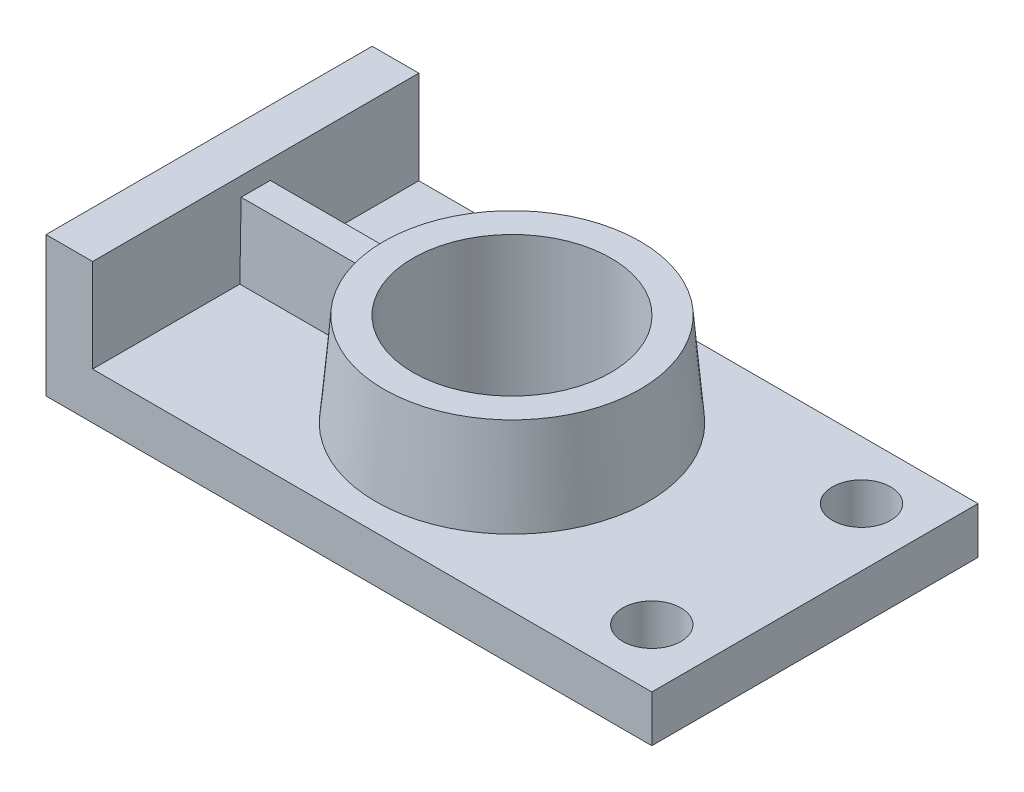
ISO-10303-21;
HEADER;
FILE_DESCRIPTION(('STEP AP214'),'2;1');
FILE_NAME('part.step','',(''),(''),'','','');
FILE_SCHEMA(('AUTOMOTIVE_DESIGN { 1 0 10303 214 1 1 1 1 }'));
ENDSEC;
DATA;
#1=APPLICATION_CONTEXT('core data for automotive mechanical design processes');
#2=APPLICATION_PROTOCOL_DEFINITION('international standard','automotive_design',2000,#1);
#3=PRODUCT_CONTEXT('',#1,'mechanical');
#4=PRODUCT('Part','Part','',(#3));
#5=PRODUCT_RELATED_PRODUCT_CATEGORY('part','',(#4));
#6=PRODUCT_DEFINITION_FORMATION('','',#4);
#7=PRODUCT_DEFINITION_CONTEXT('part definition',#1,'design');
#8=PRODUCT_DEFINITION('design','',#6,#7);
#9=PRODUCT_DEFINITION_SHAPE('','',#8);
#10=(LENGTH_UNIT() NAMED_UNIT(*) SI_UNIT(.MILLI.,.METRE.));
#11=(NAMED_UNIT(*) PLANE_ANGLE_UNIT() SI_UNIT($,.RADIAN.));
#12=(NAMED_UNIT(*) SI_UNIT($,.STERADIAN.) SOLID_ANGLE_UNIT());
#13=UNCERTAINTY_MEASURE_WITH_UNIT(LENGTH_MEASURE(1.E-05),#10,'distance_accuracy_value','');
#14=(GEOMETRIC_REPRESENTATION_CONTEXT(3) GLOBAL_UNCERTAINTY_ASSIGNED_CONTEXT((#13)) GLOBAL_UNIT_ASSIGNED_CONTEXT((#10,
#11,#12)) REPRESENTATION_CONTEXT('',''));
#15=CARTESIAN_POINT('',(0.,0.,0.));
#16=DIRECTION('',(0.,0.,1.));
#17=DIRECTION('',(1.,0.,0.));
#18=AXIS2_PLACEMENT_3D('',#15,#16,#17);
#19=CARTESIAN_POINT('',(0.,0.,-88.9));
#20=DIRECTION('',(0.,-1.,0.));
#21=DIRECTION('',(0.,0.,-1.));
#22=AXIS2_PLACEMENT_3D('',#19,#20,#21);
#23=PLANE('',#22);
#24=CARTESIAN_POINT('',(82.55,0.,-44.4500000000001));
#25=DIRECTION('',(0.,1.,0.));
#26=DIRECTION('',(0.,0.,1.));
#27=AXIS2_PLACEMENT_3D('',#24,#25,#26);
#28=CIRCLE('',#27,26.9875);
#29=CARTESIAN_POINT('',(82.55,0.,-17.4625000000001));
#30=VERTEX_POINT('',#29);
#31=EDGE_CURVE('E130',#30,#30,#28,.T.);
#32=ORIENTED_EDGE('',*,*,#31,.T.);
#33=EDGE_LOOP('',(#32));
#34=FACE_BOUND('',#33,.T.);
#35=DIRECTION('',(0.,0.,1.));
#36=VECTOR('',#35,1.);
#37=CARTESIAN_POINT('',(165.1,0.,-88.9));
#38=LINE('',#37,#36);
#39=CARTESIAN_POINT('',(165.1,0.,-88.9));
#40=VERTEX_POINT('',#39);
#41=CARTESIAN_POINT('',(165.1,0.,0.));
#42=VERTEX_POINT('',#41);
#43=EDGE_CURVE('E200',#40,#42,#38,.T.);
#44=ORIENTED_EDGE('',*,*,#43,.T.);
#45=DIRECTION('',(1.,0.,0.));
#46=VECTOR('',#45,1.);
#47=CARTESIAN_POINT('',(0.,0.,0.));
#48=LINE('',#47,#46);
#49=CARTESIAN_POINT('',(0.,0.,0.));
#50=VERTEX_POINT('',#49);
#51=EDGE_CURVE('E183',#50,#42,#48,.T.);
#52=ORIENTED_EDGE('',*,*,#51,.F.);
#53=DIRECTION('',(0.,0.,1.));
#54=VECTOR('',#53,1.);
#55=CARTESIAN_POINT('',(0.,0.,-88.9));
#56=LINE('',#55,#54);
#57=CARTESIAN_POINT('',(0.,0.,-88.9));
#58=VERTEX_POINT('',#57);
#59=EDGE_CURVE('E120',#58,#50,#56,.T.);
#60=ORIENTED_EDGE('',*,*,#59,.F.);
#61=DIRECTION('',(1.,0.,0.));
#62=VECTOR('',#61,1.);
#63=CARTESIAN_POINT('',(0.,0.,-88.9));
#64=LINE('',#63,#62);
#65=EDGE_CURVE('E185',#58,#40,#64,.T.);
#66=ORIENTED_EDGE('',*,*,#65,.T.);
#67=EDGE_LOOP('',(#44,#52,#60,#66));
#68=FACE_BOUND('',#67,.T.);
#69=CARTESIAN_POINT('',(149.225,0.,-73.025));
#70=DIRECTION('',(0.,1.,0.));
#71=DIRECTION('',(0.,0.,1.));
#72=AXIS2_PLACEMENT_3D('',#69,#70,#71);
#73=CIRCLE('',#72,7.93749999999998);
#74=CARTESIAN_POINT('',(149.225,0.,-65.0875));
#75=VERTEX_POINT('',#74);
#76=EDGE_CURVE('E144',#75,#75,#73,.T.);
#77=ORIENTED_EDGE('',*,*,#76,.T.);
#78=EDGE_LOOP('',(#77));
#79=FACE_BOUND('',#78,.T.);
#80=CARTESIAN_POINT('',(149.225,0.,-15.875));
#81=DIRECTION('',(0.,1.,0.));
#82=DIRECTION('',(0.,0.,1.));
#83=AXIS2_PLACEMENT_3D('',#80,#81,#82);
#84=CIRCLE('',#83,7.93749999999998);
#85=CARTESIAN_POINT('',(149.225,0.,-7.93750000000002));
#86=VERTEX_POINT('',#85);
#87=EDGE_CURVE('E172',#86,#86,#84,.T.);
#88=ORIENTED_EDGE('',*,*,#87,.T.);
#89=EDGE_LOOP('',(#88));
#90=FACE_BOUND('',#89,.T.);
#91=ADVANCED_FACE('F32',(#34,#68,#79,#90),#23,.T.);
#92=CARTESIAN_POINT('',(0.,38.1,-88.9));
#93=DIRECTION('',(-1.,0.,0.));
#94=DIRECTION('',(0.,-1.,0.));
#95=AXIS2_PLACEMENT_3D('',#92,#93,#94);
#96=PLANE('',#95);
#97=ORIENTED_EDGE('',*,*,#59,.T.);
#98=DIRECTION('',(0.,-1.,0.));
#99=VECTOR('',#98,1.);
#100=CARTESIAN_POINT('',(0.,38.1,0.));
#101=LINE('',#100,#99);
#102=CARTESIAN_POINT('',(0.,38.1,0.));
#103=VERTEX_POINT('',#102);
#104=EDGE_CURVE('E189',#103,#50,#101,.T.);
#105=ORIENTED_EDGE('',*,*,#104,.F.);
#106=DIRECTION('',(0.,0.,1.));
#107=VECTOR('',#106,1.);
#108=CARTESIAN_POINT('',(0.,38.1,-88.9));
#109=LINE('',#108,#107);
#110=CARTESIAN_POINT('',(0.,38.1,-88.9));
#111=VERTEX_POINT('',#110);
#112=EDGE_CURVE('E217',#111,#103,#109,.T.);
#113=ORIENTED_EDGE('',*,*,#112,.F.);
#114=DIRECTION('',(0.,-1.,0.));
#115=VECTOR('',#114,1.);
#116=CARTESIAN_POINT('',(0.,38.1,-88.9));
#117=LINE('',#116,#115);
#118=EDGE_CURVE('E197',#111,#58,#117,.T.);
#119=ORIENTED_EDGE('',*,*,#118,.T.);
#120=EDGE_LOOP('',(#97,#105,#113,#119));
#121=FACE_BOUND('',#120,.T.);
#122=ADVANCED_FACE('F243',(#121),#96,.T.);
#123=CARTESIAN_POINT('',(0.,38.1,-88.9));
#124=DIRECTION('',(0.,-1.,0.));
#125=DIRECTION('',(0.,0.,-1.));
#126=AXIS2_PLACEMENT_3D('',#123,#124,#125);
#127=PLANE('',#126);
#128=DIRECTION('',(1.,0.,0.));
#129=VECTOR('',#128,1.);
#130=CARTESIAN_POINT('',(0.,38.1,0.));
#131=LINE('',#130,#129);
#132=CARTESIAN_POINT('',(12.7,38.1,0.));
#133=VERTEX_POINT('',#132);
#134=EDGE_CURVE('E212',#103,#133,#131,.T.);
#135=ORIENTED_EDGE('',*,*,#134,.T.);
#136=DIRECTION('',(0.,0.,1.));
#137=VECTOR('',#136,1.);
#138=CARTESIAN_POINT('',(12.7,38.1,-88.9));
#139=LINE('',#138,#137);
#140=CARTESIAN_POINT('',(12.7,38.1,-88.9));
#141=VERTEX_POINT('',#140);
#142=EDGE_CURVE('E219',#141,#133,#139,.T.);
#143=ORIENTED_EDGE('',*,*,#142,.F.);
#144=DIRECTION('',(1.,0.,0.));
#145=VECTOR('',#144,1.);
#146=CARTESIAN_POINT('',(0.,38.1,-88.9));
#147=LINE('',#146,#145);
#148=EDGE_CURVE('E195',#111,#141,#147,.T.);
#149=ORIENTED_EDGE('',*,*,#148,.F.);
#150=ORIENTED_EDGE('',*,*,#112,.T.);
#151=EDGE_LOOP('',(#135,#143,#149,#150));
#152=FACE_BOUND('',#151,.T.);
#153=ADVANCED_FACE('F252',(#152),#127,.F.);
#154=CARTESIAN_POINT('',(12.7,38.1,-88.9));
#155=DIRECTION('',(-1.,0.,0.));
#156=DIRECTION('',(0.,-1.,0.));
#157=AXIS2_PLACEMENT_3D('',#154,#155,#156);
#158=PLANE('',#157);
#159=DIRECTION('',(0.,0.,1.));
#160=VECTOR('',#159,1.);
#161=CARTESIAN_POINT('',(12.7,12.7,-88.9));
#162=LINE('',#161,#160);
#163=CARTESIAN_POINT('',(12.7,12.7,-40.1265630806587));
#164=VERTEX_POINT('',#163);
#165=CARTESIAN_POINT('',(12.7,12.7,0.));
#166=VERTEX_POINT('',#165);
#167=EDGE_CURVE('E223',#164,#166,#162,.T.);
#168=ORIENTED_EDGE('',*,*,#167,.F.);
#169=DIRECTION('',(0.,-0.999847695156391,0.0174524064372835));
#170=VECTOR('',#169,1.);
#171=CARTESIAN_POINT('',(12.7,38.9433477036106,-40.584642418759));
#172=LINE('',#171,#170);
#173=CARTESIAN_POINT('',(12.7,33.02,-40.4812500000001));
#174=VERTEX_POINT('',#173);
#175=EDGE_CURVE('E159',#164,#174,#172,.F.);
#176=ORIENTED_EDGE('',*,*,#175,.T.);
#177=DIRECTION('',(0.,0.,-1.));
#178=VECTOR('',#177,1.);
#179=CARTESIAN_POINT('',(12.7,33.02,-88.9));
#180=LINE('',#179,#178);
#181=CARTESIAN_POINT('',(12.7,33.02,-48.4187500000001));
#182=VERTEX_POINT('',#181);
#183=EDGE_CURVE('E160',#174,#182,#180,.T.);
#184=ORIENTED_EDGE('',*,*,#183,.T.);
#185=DIRECTION('',(0.,0.999847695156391,0.0174524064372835));
#186=VECTOR('',#185,1.);
#187=CARTESIAN_POINT('',(12.7,37.3920650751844,-48.3424353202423));
#188=LINE('',#187,#186);
#189=CARTESIAN_POINT('',(12.7,12.7,-48.7734369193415));
#190=VERTEX_POINT('',#189);
#191=EDGE_CURVE('E157',#190,#182,#188,.T.);
#192=ORIENTED_EDGE('',*,*,#191,.F.);
#193=CARTESIAN_POINT('',(12.7,12.7,-88.9));
#194=VERTEX_POINT('',#193);
#195=EDGE_CURVE('E116',#194,#190,#162,.T.);
#196=ORIENTED_EDGE('',*,*,#195,.F.);
#197=DIRECTION('',(0.,-1.,0.));
#198=VECTOR('',#197,1.);
#199=CARTESIAN_POINT('',(12.7,38.1,-88.9));
#200=LINE('',#199,#198);
#201=EDGE_CURVE('E193',#141,#194,#200,.T.);
#202=ORIENTED_EDGE('',*,*,#201,.F.);
#203=ORIENTED_EDGE('',*,*,#142,.T.);
#204=DIRECTION('',(0.,-1.,0.));
#205=VECTOR('',#204,1.);
#206=CARTESIAN_POINT('',(12.7,38.1,0.));
#207=LINE('',#206,#205);
#208=EDGE_CURVE('E209',#133,#166,#207,.T.);
#209=ORIENTED_EDGE('',*,*,#208,.T.);
#210=EDGE_LOOP('',(#168,#176,#184,#192,#196,#202,#203,#209));
#211=FACE_BOUND('',#210,.T.);
#212=ADVANCED_FACE('F249',(#211),#158,.F.);
#213=CARTESIAN_POINT('',(0.,12.7,-88.9));
#214=DIRECTION('',(0.,-1.,0.));
#215=DIRECTION('',(0.,0.,-1.));
#216=AXIS2_PLACEMENT_3D('',#213,#214,#215);
#217=PLANE('',#216);
#218=DIRECTION('',(-1.,0.,0.));
#219=VECTOR('',#218,1.);
#220=CARTESIAN_POINT('',(0.,12.7,-48.7734369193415));
#221=LINE('',#220,#219);
#222=CARTESIAN_POINT('',(45.655240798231,12.7,-48.7734369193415));
#223=VERTEX_POINT('',#222);
#224=EDGE_CURVE('E39',#223,#190,#221,.T.);
#225=ORIENTED_EDGE('',*,*,#224,.F.);
#226=CARTESIAN_POINT('',(82.55,12.7,-44.4500000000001));
#227=DIRECTION('',(0.,-1.,0.));
#228=DIRECTION('',(0.,0.,-1.));
#229=AXIS2_PLACEMENT_3D('',#226,#227,#228);
#230=CIRCLE('',#229,37.1472120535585);
#231=CARTESIAN_POINT('',(45.655240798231,12.7,-40.1265630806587));
#232=VERTEX_POINT('',#231);
#233=EDGE_CURVE('E113',#232,#223,#230,.F.);
#234=ORIENTED_EDGE('',*,*,#233,.F.);
#235=DIRECTION('',(1.,0.,0.));
#236=VECTOR('',#235,1.);
#237=CARTESIAN_POINT('',(0.,12.7,-40.1265630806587));
#238=LINE('',#237,#236);
#239=EDGE_CURVE('E11',#232,#164,#238,.F.);
#240=ORIENTED_EDGE('',*,*,#239,.T.);
#241=ORIENTED_EDGE('',*,*,#167,.T.);
#242=DIRECTION('',(1.,0.,0.));
#243=VECTOR('',#242,1.);
#244=CARTESIAN_POINT('',(0.,12.7,0.));
#245=LINE('',#244,#243);
#246=CARTESIAN_POINT('',(165.1,12.7,0.));
#247=VERTEX_POINT('',#246);
#248=EDGE_CURVE('E206',#166,#247,#245,.T.);
#249=ORIENTED_EDGE('',*,*,#248,.T.);
#250=DIRECTION('',(0.,0.,1.));
#251=VECTOR('',#250,1.);
#252=CARTESIAN_POINT('',(165.1,12.7,-88.9));
#253=LINE('',#252,#251);
#254=CARTESIAN_POINT('',(165.1,12.7,-88.9));
#255=VERTEX_POINT('',#254);
#256=EDGE_CURVE('E224',#255,#247,#253,.T.);
#257=ORIENTED_EDGE('',*,*,#256,.F.);
#258=DIRECTION('',(1.,0.,0.));
#259=VECTOR('',#258,1.);
#260=CARTESIAN_POINT('',(0.,12.7,-88.9));
#261=LINE('',#260,#259);
#262=EDGE_CURVE('E191',#194,#255,#261,.T.);
#263=ORIENTED_EDGE('',*,*,#262,.F.);
#264=ORIENTED_EDGE('',*,*,#195,.T.);
#265=EDGE_LOOP('',(#225,#234,#240,#241,#249,#257,#263,#264));
#266=FACE_BOUND('',#265,.T.);
#267=CARTESIAN_POINT('',(149.225,12.7,-73.025));
#268=DIRECTION('',(0.,1.,0.));
#269=DIRECTION('',(0.,0.,1.));
#270=AXIS2_PLACEMENT_3D('',#267,#268,#269);
#271=CIRCLE('',#270,7.93749999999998);
#272=CARTESIAN_POINT('',(149.225,12.7,-65.0875));
#273=VERTEX_POINT('',#272);
#274=EDGE_CURVE('E163',#273,#273,#271,.T.);
#275=ORIENTED_EDGE('',*,*,#274,.F.);
#276=EDGE_LOOP('',(#275));
#277=FACE_BOUND('',#276,.T.);
#278=CARTESIAN_POINT('',(149.225,12.7,-15.875));
#279=DIRECTION('',(0.,1.,0.));
#280=DIRECTION('',(0.,0.,1.));
#281=AXIS2_PLACEMENT_3D('',#278,#279,#280);
#282=CIRCLE('',#281,7.93749999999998);
#283=CARTESIAN_POINT('',(149.225,12.7,-7.93750000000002));
#284=VERTEX_POINT('',#283);
#285=EDGE_CURVE('E170',#284,#284,#282,.T.);
#286=ORIENTED_EDGE('',*,*,#285,.F.);
#287=EDGE_LOOP('',(#286));
#288=FACE_BOUND('',#287,.T.);
#289=ADVANCED_FACE('F111',(#266,#277,#288),#217,.F.);
#290=CARTESIAN_POINT('',(165.1,12.7,-88.9));
#291=DIRECTION('',(-1.,0.,0.));
#292=DIRECTION('',(0.,0.,1.));
#293=AXIS2_PLACEMENT_3D('',#290,#291,#292);
#294=PLANE('',#293);
#295=ORIENTED_EDGE('',*,*,#256,.T.);
#296=DIRECTION('',(0.,-1.,0.));
#297=VECTOR('',#296,1.);
#298=CARTESIAN_POINT('',(165.1,12.7,0.));
#299=LINE('',#298,#297);
#300=EDGE_CURVE('E203',#247,#42,#299,.T.);
#301=ORIENTED_EDGE('',*,*,#300,.T.);
#302=ORIENTED_EDGE('',*,*,#43,.F.);
#303=DIRECTION('',(0.,-1.,0.));
#304=VECTOR('',#303,1.);
#305=CARTESIAN_POINT('',(165.1,12.7,-88.9));
#306=LINE('',#305,#304);
#307=EDGE_CURVE('E188',#255,#40,#306,.T.);
#308=ORIENTED_EDGE('',*,*,#307,.F.);
#309=EDGE_LOOP('',(#295,#301,#302,#308));
#310=FACE_BOUND('',#309,.T.);
#311=ADVANCED_FACE('F234',(#310),#294,.F.);
#312=CARTESIAN_POINT('',(165.1,0.,-88.9));
#313=DIRECTION('',(0.,0.,-1.));
#314=DIRECTION('',(-1.,0.,0.));
#315=AXIS2_PLACEMENT_3D('',#312,#313,#314);
#316=PLANE('',#315);
#317=ORIENTED_EDGE('',*,*,#65,.F.);
#318=ORIENTED_EDGE('',*,*,#118,.F.);
#319=ORIENTED_EDGE('',*,*,#148,.T.);
#320=ORIENTED_EDGE('',*,*,#201,.T.);
#321=ORIENTED_EDGE('',*,*,#262,.T.);
#322=ORIENTED_EDGE('',*,*,#307,.T.);
#323=EDGE_LOOP('',(#317,#318,#319,#320,#321,#322));
#324=FACE_BOUND('',#323,.T.);
#325=ADVANCED_FACE('F247',(#324),#316,.T.);
#326=CARTESIAN_POINT('',(165.1,0.,0.));
#327=DIRECTION('',(0.,0.,-1.));
#328=DIRECTION('',(-1.,0.,0.));
#329=AXIS2_PLACEMENT_3D('',#326,#327,#328);
#330=PLANE('',#329);
#331=ORIENTED_EDGE('',*,*,#51,.T.);
#332=ORIENTED_EDGE('',*,*,#300,.F.);
#333=ORIENTED_EDGE('',*,*,#248,.F.);
#334=ORIENTED_EDGE('',*,*,#208,.F.);
#335=ORIENTED_EDGE('',*,*,#134,.F.);
#336=ORIENTED_EDGE('',*,*,#104,.T.);
#337=EDGE_LOOP('',(#331,#332,#333,#334,#335,#336));
#338=FACE_BOUND('',#337,.T.);
#339=ADVANCED_FACE('F238',(#338),#330,.F.);
#340=CARTESIAN_POINT('',(82.55,38.1,-44.4500000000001));
#341=DIRECTION('',(0.,1.,0.));
#342=DIRECTION('',(0.,0.,1.));
#343=AXIS2_PLACEMENT_3D('',#340,#341,#342);
#344=PLANE('',#343);
#345=CARTESIAN_POINT('',(82.55,38.1,-44.4500000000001));
#346=DIRECTION('',(0.,1.,0.));
#347=DIRECTION('',(0.,0.,1.));
#348=AXIS2_PLACEMENT_3D('',#345,#346,#347);
#349=CIRCLE('',#348,26.9875);
#350=CARTESIAN_POINT('',(82.55,38.1,-17.4625000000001));
#351=VERTEX_POINT('',#350);
#352=EDGE_CURVE('E175',#351,#351,#349,.T.);
#353=ORIENTED_EDGE('',*,*,#352,.F.);
#354=EDGE_LOOP('',(#353));
#355=FACE_BOUND('',#354,.T.);
#356=CARTESIAN_POINT('',(82.55,38.1,-44.4500000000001));
#357=DIRECTION('',(0.,1.,0.));
#358=DIRECTION('',(0.,0.,1.));
#359=AXIS2_PLACEMENT_3D('',#356,#357,#358);
#360=CIRCLE('',#359,34.925);
#361=CARTESIAN_POINT('',(82.55,38.1,-9.52500000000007));
#362=VERTEX_POINT('',#361);
#363=EDGE_CURVE('E129',#362,#362,#360,.T.);
#364=ORIENTED_EDGE('',*,*,#363,.T.);
#365=EDGE_LOOP('',(#364));
#366=FACE_BOUND('',#365,.T.);
#367=ADVANCED_FACE('F274',(#355,#366),#344,.T.);
#368=CARTESIAN_POINT('',(82.55,38.1,-44.4500000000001));
#369=DIRECTION('',(0.,-1.,0.));
#370=DIRECTION('',(0.,0.,1.));
#371=AXIS2_PLACEMENT_3D('',#368,#369,#370);
#372=CONICAL_SURFACE('',#371,34.925,0.0872664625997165);
#373=ORIENTED_EDGE('',*,*,#233,.T.);
#374=CARTESIAN_POINT('',(47.4039437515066,33.0202,-48.4187465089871));
#375=CARTESIAN_POINT('',(47.1124370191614,29.6334712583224,-48.4778620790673));
#376=CARTESIAN_POINT('',(46.8209569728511,26.2467402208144,-48.5369776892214));
#377=CARTESIAN_POINT('',(46.2380502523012,19.4732735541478,-48.6552089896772));
#378=CARTESIAN_POINT('',(45.9466235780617,16.0865379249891,-48.7143246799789));
#379=CARTESIAN_POINT('',(45.6552235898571,12.6998,-48.7734404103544));
#380=B_SPLINE_CURVE_WITH_KNOTS('',3,(#374,#375,#376,#377,#378,#379),.UNSPECIFIED.,.F.,.F.,(4,2,
4),(0.,10.1992951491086,20.3985902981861),.UNSPECIFIED.);
#381=CARTESIAN_POINT('',(47.4039265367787,33.02,-48.4187500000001));
#382=VERTEX_POINT('',#381);
#383=EDGE_CURVE('E127',#382,#223,#380,.T.);
#384=ORIENTED_EDGE('',*,*,#383,.F.);
#385=CARTESIAN_POINT('',(82.55,33.02,-44.4500000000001));
#386=DIRECTION('',(0.,1.,0.));
#387=DIRECTION('',(0.,0.,1.));
#388=AXIS2_PLACEMENT_3D('',#385,#386,#387);
#389=CIRCLE('',#388,35.3694424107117);
#390=CARTESIAN_POINT('',(47.4039265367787,33.02,-40.4812500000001));
#391=VERTEX_POINT('',#390);
#392=EDGE_CURVE('E134',#391,#382,#389,.F.);
#393=ORIENTED_EDGE('',*,*,#392,.F.);
#394=CARTESIAN_POINT('',(47.4039437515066,33.0202,-40.4812534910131));
#395=CARTESIAN_POINT('',(47.1124370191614,29.6334712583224,-40.4221379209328));
#396=CARTESIAN_POINT('',(46.8209569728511,26.2467402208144,-40.3630223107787));
#397=CARTESIAN_POINT('',(46.2380502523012,19.4732735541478,-40.2447910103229));
#398=CARTESIAN_POINT('',(45.9466235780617,16.0865379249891,-40.1856753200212));
#399=CARTESIAN_POINT('',(45.6552235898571,12.6998,-40.1265595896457));
#400=B_SPLINE_CURVE_WITH_KNOTS('',3,(#394,#395,#396,#397,#398,#399),.UNSPECIFIED.,.F.,.F.,(4,2,
4),(0.,10.1992951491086,20.3985902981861),.UNSPECIFIED.);
#401=EDGE_CURVE('E128',#391,#232,#400,.T.);
#402=ORIENTED_EDGE('',*,*,#401,.T.);
#403=EDGE_LOOP('',(#373,#384,#393,#402));
#404=FACE_BOUND('',#403,.T.);
#405=ORIENTED_EDGE('',*,*,#363,.F.);
#406=EDGE_LOOP('',(#405));
#407=FACE_BOUND('',#406,.T.);
#408=ADVANCED_FACE('F124',(#404,#407),#372,.T.);
#409=CARTESIAN_POINT('',(82.55,0.,-44.4500000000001));
#410=DIRECTION('',(0.,1.,0.));
#411=DIRECTION('',(0.,0.,1.));
#412=AXIS2_PLACEMENT_3D('',#409,#410,#411);
#413=CYLINDRICAL_SURFACE('',#412,26.9875);
#414=CARTESIAN_POINT('',(82.55,0.,-17.4625000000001));
#415=CARTESIAN_POINT('',(82.55,0.396875,-17.4625000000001));
#416=CARTESIAN_POINT('',(82.55,0.79375,-17.4625000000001));
#417=CARTESIAN_POINT('',(82.55,1.5875,-17.4625000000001));
#418=CARTESIAN_POINT('',(82.55,1.984375,-17.4625000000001));
#419=CARTESIAN_POINT('',(82.55,2.778125,-17.4625000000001));
#420=CARTESIAN_POINT('',(82.55,3.175,-17.4625000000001));
#421=CARTESIAN_POINT('',(82.55,3.96875,-17.4625000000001));
#422=CARTESIAN_POINT('',(82.55,4.365625,-17.4625000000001));
#423=CARTESIAN_POINT('',(82.55,5.159375,-17.4625000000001));
#424=CARTESIAN_POINT('',(82.55,5.55625,-17.4625000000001));
#425=CARTESIAN_POINT('',(82.55,6.35,-17.4625000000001));
#426=CARTESIAN_POINT('',(82.55,6.746875,-17.4625000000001));
#427=CARTESIAN_POINT('',(82.55,7.540625,-17.4625000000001));
#428=CARTESIAN_POINT('',(82.55,7.9375,-17.4625000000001));
#429=CARTESIAN_POINT('',(82.55,8.73125,-17.4625000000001));
#430=CARTESIAN_POINT('',(82.55,9.128125,-17.4625000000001));
#431=CARTESIAN_POINT('',(82.55,9.921875,-17.4625000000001));
#432=CARTESIAN_POINT('',(82.55,10.31875,-17.4625000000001));
#433=CARTESIAN_POINT('',(82.55,11.1125,-17.4625000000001));
#434=CARTESIAN_POINT('',(82.55,11.509375,-17.4625000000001));
#435=CARTESIAN_POINT('',(82.55,12.303125,-17.4625000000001));
#436=CARTESIAN_POINT('',(82.55,12.7,-17.4625000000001));
#437=CARTESIAN_POINT('',(82.55,13.49375,-17.4625000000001));
#438=CARTESIAN_POINT('',(82.55,13.890625,-17.4625000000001));
#439=CARTESIAN_POINT('',(82.55,14.684375,-17.4625000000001));
#440=CARTESIAN_POINT('',(82.55,15.08125,-17.4625000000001));
#441=CARTESIAN_POINT('',(82.55,15.875,-17.4625000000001));
#442=CARTESIAN_POINT('',(82.55,16.271875,-17.4625000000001));
#443=CARTESIAN_POINT('',(82.55,17.065625,-17.4625000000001));
#444=CARTESIAN_POINT('',(82.55,17.4625,-17.4625000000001));
#445=CARTESIAN_POINT('',(82.55,18.25625,-17.4625000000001));
#446=CARTESIAN_POINT('',(82.55,18.653125,-17.4625000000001));
#447=CARTESIAN_POINT('',(82.55,19.446875,-17.4625000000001));
#448=CARTESIAN_POINT('',(82.55,19.84375,-17.4625000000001));
#449=CARTESIAN_POINT('',(82.55,20.6375,-17.4625000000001));
#450=CARTESIAN_POINT('',(82.55,21.034375,-17.4625000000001));
#451=CARTESIAN_POINT('',(82.55,21.828125,-17.4625000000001));
#452=CARTESIAN_POINT('',(82.55,22.225,-17.4625000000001));
#453=CARTESIAN_POINT('',(82.55,23.01875,-17.4625000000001));
#454=CARTESIAN_POINT('',(82.55,23.415625,-17.4625000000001));
#455=CARTESIAN_POINT('',(82.55,24.209375,-17.4625000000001));
#456=CARTESIAN_POINT('',(82.55,24.60625,-17.4625000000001));
#457=CARTESIAN_POINT('',(82.55,25.4,-17.4625000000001));
#458=CARTESIAN_POINT('',(82.55,25.796875,-17.4625000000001));
#459=CARTESIAN_POINT('',(82.55,26.590625,-17.4625000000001));
#460=CARTESIAN_POINT('',(82.55,26.9875,-17.4625000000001));
#461=CARTESIAN_POINT('',(82.55,27.78125,-17.4625000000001));
#462=CARTESIAN_POINT('',(82.55,28.178125,-17.4625000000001));
#463=CARTESIAN_POINT('',(82.55,28.971875,-17.4625000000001));
#464=CARTESIAN_POINT('',(82.55,29.36875,-17.4625000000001));
#465=CARTESIAN_POINT('',(82.55,30.1625,-17.4625000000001));
#466=CARTESIAN_POINT('',(82.55,30.559375,-17.4625000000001));
#467=CARTESIAN_POINT('',(82.55,31.353125,-17.4625000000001));
#468=CARTESIAN_POINT('',(82.55,31.75,-17.4625000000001));
#469=CARTESIAN_POINT('',(82.55,32.54375,-17.4625000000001));
#470=CARTESIAN_POINT('',(82.55,32.940625,-17.4625000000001));
#471=CARTESIAN_POINT('',(82.55,33.734375,-17.4625000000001));
#472=CARTESIAN_POINT('',(82.55,34.13125,-17.4625000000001));
#473=CARTESIAN_POINT('',(82.55,34.925,-17.4625000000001));
#474=CARTESIAN_POINT('',(82.55,35.321875,-17.4625000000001));
#475=CARTESIAN_POINT('',(82.55,36.115625,-17.4625000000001));
#476=CARTESIAN_POINT('',(82.55,36.5125,-17.4625000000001));
#477=CARTESIAN_POINT('',(82.55,37.30625,-17.4625000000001));
#478=CARTESIAN_POINT('',(82.55,37.703125,-17.4625000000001));
#479=CARTESIAN_POINT('',(82.55,38.1,-17.4625000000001));
#480=B_SPLINE_CURVE_WITH_KNOTS('',3,(#414,#415,#416,#417,#418,#419,#420,#421,#422,#423,#424,
#425,#426,#427,#428,#429,#430,#431,#432,#433,#434,#435,#436,#437,#438,#439,#440,#441,#442,#443,
#444,#445,#446,#447,#448,#449,#450,#451,#452,#453,#454,#455,#456,#457,#458,#459,#460,#461,#462,
#463,#464,#465,#466,#467,#468,#469,#470,#471,#472,#473,#474,#475,#476,#477,#478,#479),
.UNSPECIFIED.,.F.,.F.,(4,2,2,2,2,2,2,2,2,2,2,2,2,2,2,2,2,2,2,2,2,2,2,2,2,2,2,2,2,2,2,2,4),(0.,
1.190625,2.38125,3.571875,4.7625,5.953125,7.14375,8.334375,9.525,10.715625,11.90625,13.096875,
14.2875,15.478125,16.66875,17.859375,19.05,20.240625,21.43125,22.621875,23.8125,25.003125,
26.19375,27.384375,28.575,29.765625,30.95625,32.146875,33.3375,34.528125,35.71875,36.909375,
38.1),.UNSPECIFIED.);
#481=EDGE_CURVE('BSEAM267',#30,#351,#480,.T.);
#482=ORIENTED_EDGE('',*,*,#31,.F.);
#483=ORIENTED_EDGE('',*,*,#352,.T.);
#484=ORIENTED_EDGE('',*,*,#481,.T.);
#485=ORIENTED_EDGE('',*,*,#481,.F.);
#486=EDGE_LOOP('',(#482,#484,#483,#485));
#487=FACE_BOUND('',#486,.T.);
#488=ADVANCED_FACE('F267',(#487),#413,.F.);
#489=CARTESIAN_POINT('',(149.225,0.,-15.875));
#490=DIRECTION('',(0.,1.,0.));
#491=DIRECTION('',(0.,0.,1.));
#492=AXIS2_PLACEMENT_3D('',#489,#490,#491);
#493=CYLINDRICAL_SURFACE('',#492,7.93749999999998);
#494=ORIENTED_EDGE('',*,*,#87,.F.);
#495=EDGE_LOOP('',(#494));
#496=FACE_BOUND('',#495,.T.);
#497=ORIENTED_EDGE('',*,*,#285,.T.);
#498=EDGE_LOOP('',(#497));
#499=FACE_BOUND('',#498,.T.);
#500=ADVANCED_FACE('F270',(#496,#499),#493,.F.);
#501=CARTESIAN_POINT('',(149.225,0.,-73.025));
#502=DIRECTION('',(0.,1.,0.));
#503=DIRECTION('',(0.,0.,1.));
#504=AXIS2_PLACEMENT_3D('',#501,#502,#503);
#505=CYLINDRICAL_SURFACE('',#504,7.93749999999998);
#506=ORIENTED_EDGE('',*,*,#76,.F.);
#507=EDGE_LOOP('',(#506));
#508=FACE_BOUND('',#507,.T.);
#509=ORIENTED_EDGE('',*,*,#274,.T.);
#510=EDGE_LOOP('',(#509));
#511=FACE_BOUND('',#510,.T.);
#512=ADVANCED_FACE('F306',(#508,#511),#505,.F.);
#513=CARTESIAN_POINT('',(42.7788467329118,33.02,-40.4812500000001));
#514=DIRECTION('',(0.,-0.0174524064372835,-0.999847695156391));
#515=DIRECTION('',(0.,0.999847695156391,-0.0174524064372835));
#516=AXIS2_PLACEMENT_3D('',#513,#514,#515);
#517=PLANE('',#516);
#518=ORIENTED_EDGE('',*,*,#239,.F.);
#519=ORIENTED_EDGE('',*,*,#401,.F.);
#520=DIRECTION('',(1.,0.,0.));
#521=VECTOR('',#520,1.);
#522=CARTESIAN_POINT('',(42.7788467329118,33.02,-40.4812500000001));
#523=LINE('',#522,#521);
#524=EDGE_CURVE('E46',#391,#174,#523,.F.);
#525=ORIENTED_EDGE('',*,*,#524,.T.);
#526=ORIENTED_EDGE('',*,*,#175,.F.);
#527=EDGE_LOOP('',(#518,#519,#525,#526));
#528=FACE_BOUND('',#527,.T.);
#529=ADVANCED_FACE('F316',(#528),#517,.F.);
#530=CARTESIAN_POINT('',(42.7788467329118,33.02,-48.4187500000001));
#531=DIRECTION('',(0.,-0.0174524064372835,0.999847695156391));
#532=DIRECTION('',(0.,-0.999847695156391,-0.0174524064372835));
#533=AXIS2_PLACEMENT_3D('',#530,#531,#532);
#534=PLANE('',#533);
#535=DIRECTION('',(1.,0.,0.));
#536=VECTOR('',#535,1.);
#537=CARTESIAN_POINT('',(42.7788467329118,33.02,-48.4187500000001));
#538=LINE('',#537,#536);
#539=EDGE_CURVE('E54',#382,#182,#538,.F.);
#540=ORIENTED_EDGE('',*,*,#539,.F.);
#541=ORIENTED_EDGE('',*,*,#383,.T.);
#542=ORIENTED_EDGE('',*,*,#224,.T.);
#543=ORIENTED_EDGE('',*,*,#191,.T.);
#544=EDGE_LOOP('',(#540,#541,#542,#543));
#545=FACE_BOUND('',#544,.T.);
#546=ADVANCED_FACE('F132',(#545),#534,.F.);
#547=CARTESIAN_POINT('',(21.6504215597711,33.02,-44.4500000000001));
#548=DIRECTION('',(0.,1.,0.));
#549=DIRECTION('',(-1.,0.,0.));
#550=AXIS2_PLACEMENT_3D('',#547,#548,#549);
#551=PLANE('',#550);
#552=ORIENTED_EDGE('',*,*,#183,.F.);
#553=ORIENTED_EDGE('',*,*,#524,.F.);
#554=ORIENTED_EDGE('',*,*,#392,.T.);
#555=ORIENTED_EDGE('',*,*,#539,.T.);
#556=EDGE_LOOP('',(#552,#553,#554,#555));
#557=FACE_BOUND('',#556,.T.);
#558=ADVANCED_FACE('F376',(#557),#551,.T.);
#559=CLOSED_SHELL('',(#91,#122,#153,#212,#289,#311,#325,#339,#367,#408,#488,#500,#512,#529,#546,#558));
#560=MANIFOLD_SOLID_BREP('B2',#559);
#561=ADVANCED_BREP_SHAPE_REPRESENTATION('',(#18,#560),#14);
#562=SHAPE_DEFINITION_REPRESENTATION(#9,#561);
ENDSEC;
END-ISO-10303-21;
